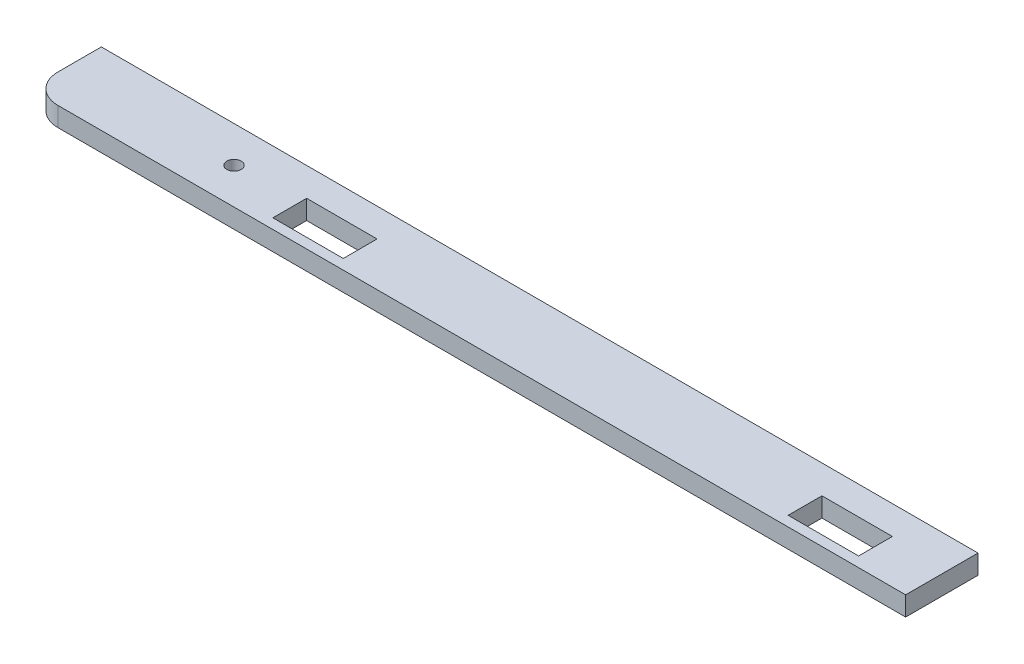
ISO-10303-21;
HEADER;
FILE_DESCRIPTION(('STEP AP214'),'2;1');
FILE_NAME('part.step','',(''),(''),'','','');
FILE_SCHEMA(('AUTOMOTIVE_DESIGN { 1 0 10303 214 1 1 1 1 }'));
ENDSEC;
DATA;
#1=APPLICATION_CONTEXT('core data for automotive mechanical design processes');
#2=APPLICATION_PROTOCOL_DEFINITION('international standard','automotive_design',2000,#1);
#3=PRODUCT_CONTEXT('',#1,'mechanical');
#4=PRODUCT('Part','Part','',(#3));
#5=PRODUCT_RELATED_PRODUCT_CATEGORY('part','',(#4));
#6=PRODUCT_DEFINITION_FORMATION('','',#4);
#7=PRODUCT_DEFINITION_CONTEXT('part definition',#1,'design');
#8=PRODUCT_DEFINITION('design','',#6,#7);
#9=PRODUCT_DEFINITION_SHAPE('','',#8);
#10=(LENGTH_UNIT() NAMED_UNIT(*) SI_UNIT(.MILLI.,.METRE.));
#11=(NAMED_UNIT(*) PLANE_ANGLE_UNIT() SI_UNIT($,.RADIAN.));
#12=(NAMED_UNIT(*) SI_UNIT($,.STERADIAN.) SOLID_ANGLE_UNIT());
#13=UNCERTAINTY_MEASURE_WITH_UNIT(LENGTH_MEASURE(1.E-05),#10,'distance_accuracy_value','');
#14=(GEOMETRIC_REPRESENTATION_CONTEXT(3) GLOBAL_UNCERTAINTY_ASSIGNED_CONTEXT((#13)) GLOBAL_UNIT_ASSIGNED_CONTEXT((#10,
#11,#12)) REPRESENTATION_CONTEXT('',''));
#15=CARTESIAN_POINT('',(0.,0.,0.));
#16=DIRECTION('',(0.,0.,1.));
#17=DIRECTION('',(1.,0.,0.));
#18=AXIS2_PLACEMENT_3D('',#15,#16,#17);
#19=CARTESIAN_POINT('',(-105.85,-1.,106.));
#20=DIRECTION('',(-1.,0.,0.));
#21=DIRECTION('',(0.,0.,1.));
#22=AXIS2_PLACEMENT_3D('',#19,#20,#21);
#23=PLANE('',#22);
#24=DIRECTION('',(0.,0.,1.));
#25=VECTOR('',#24,1.);
#26=CARTESIAN_POINT('',(-105.85,-1.,106.));
#27=LINE('',#26,#25);
#28=CARTESIAN_POINT('',(-105.85,-1.,106.));
#29=VERTEX_POINT('',#28);
#30=CARTESIAN_POINT('',(-105.85,-1.,115.));
#31=VERTEX_POINT('',#30);
#32=EDGE_CURVE('E180',#29,#31,#27,.T.);
#33=ORIENTED_EDGE('',*,*,#32,.T.);
#34=DIRECTION('',(0.,1.,0.));
#35=VECTOR('',#34,1.);
#36=CARTESIAN_POINT('',(-105.85,-1.,115.));
#37=LINE('',#36,#35);
#38=CARTESIAN_POINT('',(-105.85,3.,115.));
#39=VERTEX_POINT('',#38);
#40=EDGE_CURVE('E149',#31,#39,#37,.T.);
#41=ORIENTED_EDGE('',*,*,#40,.T.);
#42=DIRECTION('',(0.,0.,1.));
#43=VECTOR('',#42,1.);
#44=CARTESIAN_POINT('',(-105.85,3.,106.));
#45=LINE('',#44,#43);
#46=CARTESIAN_POINT('',(-105.85,3.,106.));
#47=VERTEX_POINT('',#46);
#48=EDGE_CURVE('E164',#47,#39,#45,.T.);
#49=ORIENTED_EDGE('',*,*,#48,.F.);
#50=DIRECTION('',(0.,1.,0.));
#51=VECTOR('',#50,1.);
#52=CARTESIAN_POINT('',(-105.85,-1.,106.));
#53=LINE('',#52,#51);
#54=EDGE_CURVE('E198',#29,#47,#53,.T.);
#55=ORIENTED_EDGE('',*,*,#54,.F.);
#56=EDGE_LOOP('',(#33,#41,#49,#55));
#57=FACE_BOUND('',#56,.T.);
#58=ADVANCED_FACE('F35',(#57),#23,.T.);
#59=CARTESIAN_POINT('',(75.85,-1.,106.));
#60=DIRECTION('',(0.,0.,-1.));
#61=DIRECTION('',(-1.,0.,0.));
#62=AXIS2_PLACEMENT_3D('',#59,#60,#61);
#63=PLANE('',#62);
#64=DIRECTION('',(-1.,0.,0.));
#65=VECTOR('',#64,1.);
#66=CARTESIAN_POINT('',(75.85,3.,106.));
#67=LINE('',#66,#65);
#68=CARTESIAN_POINT('',(75.85,3.,106.));
#69=VERTEX_POINT('',#68);
#70=EDGE_CURVE('E186',#69,#47,#67,.T.);
#71=ORIENTED_EDGE('',*,*,#70,.F.);
#72=DIRECTION('',(0.,1.,0.));
#73=VECTOR('',#72,1.);
#74=CARTESIAN_POINT('',(75.85,-1.,106.));
#75=LINE('',#74,#73);
#76=CARTESIAN_POINT('',(75.85,-1.,106.));
#77=VERTEX_POINT('',#76);
#78=EDGE_CURVE('E201',#77,#69,#75,.T.);
#79=ORIENTED_EDGE('',*,*,#78,.F.);
#80=DIRECTION('',(-1.,0.,0.));
#81=VECTOR('',#80,1.);
#82=CARTESIAN_POINT('',(75.85,-1.,106.));
#83=LINE('',#82,#81);
#84=EDGE_CURVE('E192',#77,#29,#83,.T.);
#85=ORIENTED_EDGE('',*,*,#84,.T.);
#86=ORIENTED_EDGE('',*,*,#54,.T.);
#87=EDGE_LOOP('',(#71,#79,#85,#86));
#88=FACE_BOUND('',#87,.T.);
#89=ADVANCED_FACE('F246',(#88),#63,.T.);
#90=CARTESIAN_POINT('',(75.85,-1.,121.));
#91=DIRECTION('',(1.,0.,0.));
#92=DIRECTION('',(0.,0.,-1.));
#93=AXIS2_PLACEMENT_3D('',#90,#91,#92);
#94=PLANE('',#93);
#95=DIRECTION('',(0.,0.,-1.));
#96=VECTOR('',#95,1.);
#97=CARTESIAN_POINT('',(75.85,3.,121.));
#98=LINE('',#97,#96);
#99=CARTESIAN_POINT('',(75.85,3.,121.));
#100=VERTEX_POINT('',#99);
#101=EDGE_CURVE('E189',#100,#69,#98,.T.);
#102=ORIENTED_EDGE('',*,*,#101,.F.);
#103=DIRECTION('',(0.,1.,0.));
#104=VECTOR('',#103,1.);
#105=CARTESIAN_POINT('',(75.85,-1.,121.));
#106=LINE('',#105,#104);
#107=CARTESIAN_POINT('',(75.85,-1.,121.));
#108=VERTEX_POINT('',#107);
#109=EDGE_CURVE('E204',#108,#100,#106,.T.);
#110=ORIENTED_EDGE('',*,*,#109,.F.);
#111=DIRECTION('',(0.,0.,-1.));
#112=VECTOR('',#111,1.);
#113=CARTESIAN_POINT('',(75.85,-1.,121.));
#114=LINE('',#113,#112);
#115=EDGE_CURVE('E200',#108,#77,#114,.T.);
#116=ORIENTED_EDGE('',*,*,#115,.T.);
#117=ORIENTED_EDGE('',*,*,#78,.T.);
#118=EDGE_LOOP('',(#102,#110,#116,#117));
#119=FACE_BOUND('',#118,.T.);
#120=ADVANCED_FACE('F242',(#119),#94,.T.);
#121=CARTESIAN_POINT('',(-105.85,-1.,121.));
#122=DIRECTION('',(0.,0.,1.));
#123=DIRECTION('',(1.,0.,0.));
#124=AXIS2_PLACEMENT_3D('',#121,#122,#123);
#125=PLANE('',#124);
#126=DIRECTION('',(1.,0.,0.));
#127=VECTOR('',#126,1.);
#128=CARTESIAN_POINT('',(-105.85,3.,121.));
#129=LINE('',#128,#127);
#130=CARTESIAN_POINT('',(-99.85,3.,121.));
#131=VERTEX_POINT('',#130);
#132=EDGE_CURVE('E187',#131,#100,#129,.T.);
#133=ORIENTED_EDGE('',*,*,#132,.F.);
#134=DIRECTION('',(0.,1.,0.));
#135=VECTOR('',#134,1.);
#136=CARTESIAN_POINT('',(-99.85,-1.,121.));
#137=LINE('',#136,#135);
#138=CARTESIAN_POINT('',(-99.85,-1.,121.));
#139=VERTEX_POINT('',#138);
#140=EDGE_CURVE('E43',#131,#139,#137,.F.);
#141=ORIENTED_EDGE('',*,*,#140,.T.);
#142=DIRECTION('',(1.,0.,0.));
#143=VECTOR('',#142,1.);
#144=CARTESIAN_POINT('',(-105.85,-1.,121.));
#145=LINE('',#144,#143);
#146=EDGE_CURVE('E203',#139,#108,#145,.T.);
#147=ORIENTED_EDGE('',*,*,#146,.T.);
#148=ORIENTED_EDGE('',*,*,#109,.T.);
#149=EDGE_LOOP('',(#133,#141,#147,#148));
#150=FACE_BOUND('',#149,.T.);
#151=ADVANCED_FACE('F253',(#150),#125,.T.);
#152=CARTESIAN_POINT('',(0.,-1.,0.));
#153=DIRECTION('',(0.,1.,0.));
#154=DIRECTION('',(0.,0.,1.));
#155=AXIS2_PLACEMENT_3D('',#152,#153,#154);
#156=PLANE('',#155);
#157=DIRECTION('',(1.,0.,0.));
#158=VECTOR('',#157,1.);
#159=CARTESIAN_POINT('',(-57.4,-1.,111.9));
#160=LINE('',#159,#158);
#161=CARTESIAN_POINT('',(-57.4,-1.,111.9));
#162=VERTEX_POINT('',#161);
#163=CARTESIAN_POINT('',(-42.7999999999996,-1.,111.9));
#164=VERTEX_POINT('',#163);
#165=EDGE_CURVE('E144',#162,#164,#160,.T.);
#166=ORIENTED_EDGE('',*,*,#165,.F.);
#167=DIRECTION('',(0.,0.,-1.));
#168=VECTOR('',#167,1.);
#169=CARTESIAN_POINT('',(-57.4,-1.,111.9));
#170=LINE('',#169,#168);
#171=CARTESIAN_POINT('',(-57.4,-1.,118.9));
#172=VERTEX_POINT('',#171);
#173=EDGE_CURVE('E127',#172,#162,#170,.T.);
#174=ORIENTED_EDGE('',*,*,#173,.F.);
#175=DIRECTION('',(-1.,0.,0.));
#176=VECTOR('',#175,1.);
#177=CARTESIAN_POINT('',(-57.4,-1.,118.9));
#178=LINE('',#177,#176);
#179=CARTESIAN_POINT('',(-42.7999999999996,-1.,118.9));
#180=VERTEX_POINT('',#179);
#181=EDGE_CURVE('E210',#180,#172,#178,.T.);
#182=ORIENTED_EDGE('',*,*,#181,.F.);
#183=DIRECTION('',(0.,0.,1.));
#184=VECTOR('',#183,1.);
#185=CARTESIAN_POINT('',(-42.7999999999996,-1.,111.9));
#186=LINE('',#185,#184);
#187=EDGE_CURVE('E154',#164,#180,#186,.T.);
#188=ORIENTED_EDGE('',*,*,#187,.F.);
#189=EDGE_LOOP('',(#166,#174,#182,#188));
#190=FACE_BOUND('',#189,.T.);
#191=DIRECTION('',(-1.,0.,0.));
#192=VECTOR('',#191,1.);
#193=CARTESIAN_POINT('',(49.3999999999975,-1.,111.899999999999));
#194=LINE('',#193,#192);
#195=CARTESIAN_POINT('',(63.9999999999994,-1.,111.899999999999));
#196=VERTEX_POINT('',#195);
#197=CARTESIAN_POINT('',(49.3999999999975,-1.,111.899999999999));
#198=VERTEX_POINT('',#197);
#199=EDGE_CURVE('E206',#196,#198,#194,.T.);
#200=ORIENTED_EDGE('',*,*,#199,.T.);
#201=DIRECTION('',(0.,0.,1.));
#202=VECTOR('',#201,1.);
#203=CARTESIAN_POINT('',(49.3999999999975,-1.,111.899999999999));
#204=LINE('',#203,#202);
#205=CARTESIAN_POINT('',(49.3999999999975,-1.,118.9));
#206=VERTEX_POINT('',#205);
#207=EDGE_CURVE('E402',#198,#206,#204,.T.);
#208=ORIENTED_EDGE('',*,*,#207,.T.);
#209=DIRECTION('',(1.,0.,0.));
#210=VECTOR('',#209,1.);
#211=CARTESIAN_POINT('',(49.3999999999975,-1.,118.9));
#212=LINE('',#211,#210);
#213=CARTESIAN_POINT('',(63.9999999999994,-1.,118.899999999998));
#214=VERTEX_POINT('',#213);
#215=EDGE_CURVE('E407',#206,#214,#212,.T.);
#216=ORIENTED_EDGE('',*,*,#215,.T.);
#217=DIRECTION('',(0.,0.,-1.));
#218=VECTOR('',#217,1.);
#219=CARTESIAN_POINT('',(63.9999999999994,-1.,111.899999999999));
#220=LINE('',#219,#218);
#221=EDGE_CURVE('E406',#214,#196,#220,.T.);
#222=ORIENTED_EDGE('',*,*,#221,.T.);
#223=EDGE_LOOP('',(#200,#208,#216,#222));
#224=FACE_BOUND('',#223,.T.);
#225=CARTESIAN_POINT('',(-70.85,-1.,113.5));
#226=DIRECTION('',(0.,1.,0.));
#227=DIRECTION('',(0.,0.,1.));
#228=AXIS2_PLACEMENT_3D('',#225,#226,#227);
#229=CIRCLE('',#228,1.5);
#230=CARTESIAN_POINT('',(-70.85,-1.,115.));
#231=VERTEX_POINT('',#230);
#232=EDGE_CURVE('E171',#231,#231,#229,.T.);
#233=ORIENTED_EDGE('',*,*,#232,.T.);
#234=EDGE_LOOP('',(#233));
#235=FACE_BOUND('',#234,.T.);
#236=ORIENTED_EDGE('',*,*,#146,.F.);
#237=CARTESIAN_POINT('',(-99.85,-1.,115.));
#238=DIRECTION('',(0.,1.,0.));
#239=DIRECTION('',(0.,0.,1.));
#240=AXIS2_PLACEMENT_3D('',#237,#238,#239);
#241=CIRCLE('',#240,6.);
#242=EDGE_CURVE('E11',#139,#31,#241,.F.);
#243=ORIENTED_EDGE('',*,*,#242,.T.);
#244=ORIENTED_EDGE('',*,*,#32,.F.);
#245=ORIENTED_EDGE('',*,*,#84,.F.);
#246=ORIENTED_EDGE('',*,*,#115,.F.);
#247=EDGE_LOOP('',(#236,#243,#244,#245,#246));
#248=FACE_BOUND('',#247,.T.);
#249=ADVANCED_FACE('F151',(#190,#224,#235,#248),#156,.F.);
#250=CARTESIAN_POINT('',(0.,3.,0.));
#251=DIRECTION('',(0.,1.,0.));
#252=DIRECTION('',(0.,0.,1.));
#253=AXIS2_PLACEMENT_3D('',#250,#251,#252);
#254=PLANE('',#253);
#255=DIRECTION('',(0.,0.,-1.));
#256=VECTOR('',#255,1.);
#257=CARTESIAN_POINT('',(-57.4,3.,111.9));
#258=LINE('',#257,#256);
#259=CARTESIAN_POINT('',(-57.4,3.,118.9));
#260=VERTEX_POINT('',#259);
#261=CARTESIAN_POINT('',(-57.4,3.,111.9));
#262=VERTEX_POINT('',#261);
#263=EDGE_CURVE('E169',#260,#262,#258,.T.);
#264=ORIENTED_EDGE('',*,*,#263,.T.);
#265=DIRECTION('',(1.,0.,0.));
#266=VECTOR('',#265,1.);
#267=CARTESIAN_POINT('',(-57.4,3.,111.9));
#268=LINE('',#267,#266);
#269=CARTESIAN_POINT('',(-42.7999999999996,3.,111.9));
#270=VERTEX_POINT('',#269);
#271=EDGE_CURVE('E147',#262,#270,#268,.T.);
#272=ORIENTED_EDGE('',*,*,#271,.T.);
#273=DIRECTION('',(0.,0.,1.));
#274=VECTOR('',#273,1.);
#275=CARTESIAN_POINT('',(-42.7999999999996,3.,111.9));
#276=LINE('',#275,#274);
#277=CARTESIAN_POINT('',(-42.7999999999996,3.,118.9));
#278=VERTEX_POINT('',#277);
#279=EDGE_CURVE('E165',#270,#278,#276,.T.);
#280=ORIENTED_EDGE('',*,*,#279,.T.);
#281=DIRECTION('',(-1.,0.,0.));
#282=VECTOR('',#281,1.);
#283=CARTESIAN_POINT('',(-57.4,3.,118.9));
#284=LINE('',#283,#282);
#285=EDGE_CURVE('E161',#278,#260,#284,.T.);
#286=ORIENTED_EDGE('',*,*,#285,.T.);
#287=EDGE_LOOP('',(#264,#272,#280,#286));
#288=FACE_BOUND('',#287,.T.);
#289=DIRECTION('',(0.,0.,1.));
#290=VECTOR('',#289,1.);
#291=CARTESIAN_POINT('',(49.3999999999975,3.,111.899999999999));
#292=LINE('',#291,#290);
#293=CARTESIAN_POINT('',(49.3999999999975,3.,111.899999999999));
#294=VERTEX_POINT('',#293);
#295=CARTESIAN_POINT('',(49.3999999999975,3.,118.9));
#296=VERTEX_POINT('',#295);
#297=EDGE_CURVE('E225',#294,#296,#292,.T.);
#298=ORIENTED_EDGE('',*,*,#297,.F.);
#299=DIRECTION('',(-1.,0.,0.));
#300=VECTOR('',#299,1.);
#301=CARTESIAN_POINT('',(49.3999999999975,3.,111.899999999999));
#302=LINE('',#301,#300);
#303=CARTESIAN_POINT('',(63.9999999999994,3.,111.899999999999));
#304=VERTEX_POINT('',#303);
#305=EDGE_CURVE('E393',#304,#294,#302,.T.);
#306=ORIENTED_EDGE('',*,*,#305,.F.);
#307=DIRECTION('',(0.,0.,-1.));
#308=VECTOR('',#307,1.);
#309=CARTESIAN_POINT('',(63.9999999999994,3.,111.899999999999));
#310=LINE('',#309,#308);
#311=CARTESIAN_POINT('',(63.9999999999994,3.,118.899999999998));
#312=VERTEX_POINT('',#311);
#313=EDGE_CURVE('E391',#312,#304,#310,.T.);
#314=ORIENTED_EDGE('',*,*,#313,.F.);
#315=DIRECTION('',(1.,0.,0.));
#316=VECTOR('',#315,1.);
#317=CARTESIAN_POINT('',(49.3999999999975,3.,118.9));
#318=LINE('',#317,#316);
#319=EDGE_CURVE('E384',#296,#312,#318,.T.);
#320=ORIENTED_EDGE('',*,*,#319,.F.);
#321=EDGE_LOOP('',(#298,#306,#314,#320));
#322=FACE_BOUND('',#321,.T.);
#323=CARTESIAN_POINT('',(-70.85,3.,113.5));
#324=DIRECTION('',(0.,1.,0.));
#325=DIRECTION('',(0.,0.,1.));
#326=AXIS2_PLACEMENT_3D('',#323,#324,#325);
#327=CIRCLE('',#326,1.5);
#328=CARTESIAN_POINT('',(-70.85,3.,115.));
#329=VERTEX_POINT('',#328);
#330=EDGE_CURVE('E197',#329,#329,#327,.T.);
#331=ORIENTED_EDGE('',*,*,#330,.F.);
#332=EDGE_LOOP('',(#331));
#333=FACE_BOUND('',#332,.T.);
#334=ORIENTED_EDGE('',*,*,#48,.T.);
#335=CARTESIAN_POINT('',(-99.85,3.,115.));
#336=DIRECTION('',(0.,1.,0.));
#337=DIRECTION('',(0.,0.,1.));
#338=AXIS2_PLACEMENT_3D('',#335,#336,#337);
#339=CIRCLE('',#338,6.);
#340=EDGE_CURVE('E57',#39,#131,#339,.T.);
#341=ORIENTED_EDGE('',*,*,#340,.T.);
#342=ORIENTED_EDGE('',*,*,#132,.T.);
#343=ORIENTED_EDGE('',*,*,#101,.T.);
#344=ORIENTED_EDGE('',*,*,#70,.T.);
#345=EDGE_LOOP('',(#334,#341,#342,#343,#344));
#346=FACE_BOUND('',#345,.T.);
#347=ADVANCED_FACE('F183',(#288,#322,#333,#346),#254,.T.);
#348=CARTESIAN_POINT('',(-70.85,-1.,113.5));
#349=DIRECTION('',(0.,1.,0.));
#350=DIRECTION('',(0.,0.,1.));
#351=AXIS2_PLACEMENT_3D('',#348,#349,#350);
#352=CYLINDRICAL_SURFACE('',#351,1.5);
#353=ORIENTED_EDGE('',*,*,#232,.F.);
#354=EDGE_LOOP('',(#353));
#355=FACE_BOUND('',#354,.T.);
#356=ORIENTED_EDGE('',*,*,#330,.T.);
#357=EDGE_LOOP('',(#356));
#358=FACE_BOUND('',#357,.T.);
#359=ADVANCED_FACE('F219',(#355,#358),#352,.F.);
#360=CARTESIAN_POINT('',(49.3999999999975,-1.,111.899999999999));
#361=DIRECTION('',(-1.,0.,0.));
#362=DIRECTION('',(0.,0.,1.));
#363=AXIS2_PLACEMENT_3D('',#360,#361,#362);
#364=PLANE('',#363);
#365=ORIENTED_EDGE('',*,*,#297,.T.);
#366=DIRECTION('',(0.,1.,0.));
#367=VECTOR('',#366,1.);
#368=CARTESIAN_POINT('',(49.3999999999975,-1.,118.9));
#369=LINE('',#368,#367);
#370=EDGE_CURVE('E138',#206,#296,#369,.T.);
#371=ORIENTED_EDGE('',*,*,#370,.F.);
#372=ORIENTED_EDGE('',*,*,#207,.F.);
#373=DIRECTION('',(0.,1.,0.));
#374=VECTOR('',#373,1.);
#375=CARTESIAN_POINT('',(49.3999999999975,-1.,111.899999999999));
#376=LINE('',#375,#374);
#377=EDGE_CURVE('E230',#198,#294,#376,.T.);
#378=ORIENTED_EDGE('',*,*,#377,.T.);
#379=EDGE_LOOP('',(#365,#371,#372,#378));
#380=FACE_BOUND('',#379,.T.);
#381=ADVANCED_FACE('F285',(#380),#364,.F.);
#382=CARTESIAN_POINT('',(49.3999999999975,-1.,111.899999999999));
#383=DIRECTION('',(0.,0.,-1.));
#384=DIRECTION('',(-1.,0.,0.));
#385=AXIS2_PLACEMENT_3D('',#382,#383,#384);
#386=PLANE('',#385);
#387=ORIENTED_EDGE('',*,*,#305,.T.);
#388=ORIENTED_EDGE('',*,*,#377,.F.);
#389=ORIENTED_EDGE('',*,*,#199,.F.);
#390=DIRECTION('',(0.,1.,0.));
#391=VECTOR('',#390,1.);
#392=CARTESIAN_POINT('',(63.9999999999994,-1.,111.899999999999));
#393=LINE('',#392,#391);
#394=EDGE_CURVE('E394',#196,#304,#393,.T.);
#395=ORIENTED_EDGE('',*,*,#394,.T.);
#396=EDGE_LOOP('',(#387,#388,#389,#395));
#397=FACE_BOUND('',#396,.T.);
#398=ADVANCED_FACE('F293',(#397),#386,.F.);
#399=CARTESIAN_POINT('',(63.9999999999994,-1.,111.899999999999));
#400=DIRECTION('',(1.,0.,0.));
#401=DIRECTION('',(0.,0.,-1.));
#402=AXIS2_PLACEMENT_3D('',#399,#400,#401);
#403=PLANE('',#402);
#404=ORIENTED_EDGE('',*,*,#313,.T.);
#405=ORIENTED_EDGE('',*,*,#394,.F.);
#406=ORIENTED_EDGE('',*,*,#221,.F.);
#407=DIRECTION('',(0.,1.,0.));
#408=VECTOR('',#407,1.);
#409=CARTESIAN_POINT('',(63.9999999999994,-1.,118.899999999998));
#410=LINE('',#409,#408);
#411=EDGE_CURVE('E387',#214,#312,#410,.T.);
#412=ORIENTED_EDGE('',*,*,#411,.T.);
#413=EDGE_LOOP('',(#404,#405,#406,#412));
#414=FACE_BOUND('',#413,.T.);
#415=ADVANCED_FACE('F300',(#414),#403,.F.);
#416=CARTESIAN_POINT('',(49.3999999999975,-1.,118.9));
#417=DIRECTION('',(0.,0.,1.));
#418=DIRECTION('',(1.,0.,0.));
#419=AXIS2_PLACEMENT_3D('',#416,#417,#418);
#420=PLANE('',#419);
#421=ORIENTED_EDGE('',*,*,#319,.T.);
#422=ORIENTED_EDGE('',*,*,#411,.F.);
#423=ORIENTED_EDGE('',*,*,#215,.F.);
#424=ORIENTED_EDGE('',*,*,#370,.T.);
#425=EDGE_LOOP('',(#421,#422,#423,#424));
#426=FACE_BOUND('',#425,.T.);
#427=ADVANCED_FACE('F263',(#426),#420,.F.);
#428=CARTESIAN_POINT('',(-57.4,3.,111.9));
#429=DIRECTION('',(-1.,0.,0.));
#430=DIRECTION('',(0.,0.,1.));
#431=AXIS2_PLACEMENT_3D('',#428,#429,#430);
#432=PLANE('',#431);
#433=ORIENTED_EDGE('',*,*,#173,.T.);
#434=DIRECTION('',(0.,-1.,0.));
#435=VECTOR('',#434,1.);
#436=CARTESIAN_POINT('',(-57.4,3.,111.9));
#437=LINE('',#436,#435);
#438=EDGE_CURVE('E131',#262,#162,#437,.T.);
#439=ORIENTED_EDGE('',*,*,#438,.F.);
#440=ORIENTED_EDGE('',*,*,#263,.F.);
#441=DIRECTION('',(0.,-1.,0.));
#442=VECTOR('',#441,1.);
#443=CARTESIAN_POINT('',(-57.4,3.,118.9));
#444=LINE('',#443,#442);
#445=EDGE_CURVE('E133',#260,#172,#444,.T.);
#446=ORIENTED_EDGE('',*,*,#445,.T.);
#447=EDGE_LOOP('',(#433,#439,#440,#446));
#448=FACE_BOUND('',#447,.T.);
#449=ADVANCED_FACE('F129',(#448),#432,.F.);
#450=CARTESIAN_POINT('',(-57.4,3.,118.9));
#451=DIRECTION('',(0.,0.,1.));
#452=DIRECTION('',(1.,0.,0.));
#453=AXIS2_PLACEMENT_3D('',#450,#451,#452);
#454=PLANE('',#453);
#455=ORIENTED_EDGE('',*,*,#181,.T.);
#456=ORIENTED_EDGE('',*,*,#445,.F.);
#457=ORIENTED_EDGE('',*,*,#285,.F.);
#458=DIRECTION('',(0.,-1.,0.));
#459=VECTOR('',#458,1.);
#460=CARTESIAN_POINT('',(-42.7999999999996,3.,118.9));
#461=LINE('',#460,#459);
#462=EDGE_CURVE('E208',#278,#180,#461,.T.);
#463=ORIENTED_EDGE('',*,*,#462,.T.);
#464=EDGE_LOOP('',(#455,#456,#457,#463));
#465=FACE_BOUND('',#464,.T.);
#466=ADVANCED_FACE('F212',(#465),#454,.F.);
#467=CARTESIAN_POINT('',(-42.7999999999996,3.,111.9));
#468=DIRECTION('',(1.,0.,0.));
#469=DIRECTION('',(0.,0.,-1.));
#470=AXIS2_PLACEMENT_3D('',#467,#468,#469);
#471=PLANE('',#470);
#472=ORIENTED_EDGE('',*,*,#187,.T.);
#473=ORIENTED_EDGE('',*,*,#462,.F.);
#474=ORIENTED_EDGE('',*,*,#279,.F.);
#475=DIRECTION('',(0.,-1.,0.));
#476=VECTOR('',#475,1.);
#477=CARTESIAN_POINT('',(-42.7999999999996,3.,111.9));
#478=LINE('',#477,#476);
#479=EDGE_CURVE('E155',#270,#164,#478,.T.);
#480=ORIENTED_EDGE('',*,*,#479,.T.);
#481=EDGE_LOOP('',(#472,#473,#474,#480));
#482=FACE_BOUND('',#481,.T.);
#483=ADVANCED_FACE('F215',(#482),#471,.F.);
#484=CARTESIAN_POINT('',(-57.4,3.,111.9));
#485=DIRECTION('',(0.,0.,-1.));
#486=DIRECTION('',(-1.,0.,0.));
#487=AXIS2_PLACEMENT_3D('',#484,#485,#486);
#488=PLANE('',#487);
#489=ORIENTED_EDGE('',*,*,#165,.T.);
#490=ORIENTED_EDGE('',*,*,#479,.F.);
#491=ORIENTED_EDGE('',*,*,#271,.F.);
#492=ORIENTED_EDGE('',*,*,#438,.T.);
#493=EDGE_LOOP('',(#489,#490,#491,#492));
#494=FACE_BOUND('',#493,.T.);
#495=ADVANCED_FACE('F142',(#494),#488,.F.);
#496=CARTESIAN_POINT('',(-99.85,-1.,115.));
#497=DIRECTION('',(0.,1.,0.));
#498=DIRECTION('',(0.,0.,1.));
#499=AXIS2_PLACEMENT_3D('',#496,#497,#498);
#500=CYLINDRICAL_SURFACE('',#499,6.);
#501=ORIENTED_EDGE('',*,*,#242,.F.);
#502=ORIENTED_EDGE('',*,*,#140,.F.);
#503=ORIENTED_EDGE('',*,*,#340,.F.);
#504=ORIENTED_EDGE('',*,*,#40,.F.);
#505=EDGE_LOOP('',(#501,#502,#503,#504));
#506=FACE_BOUND('',#505,.T.);
#507=ADVANCED_FACE('F37',(#506),#500,.T.);
#508=CLOSED_SHELL('',(#58,#89,#120,#151,#249,#347,#359,#381,#398,#415,#427,#449,#466,#483,#495,#507));
#509=MANIFOLD_SOLID_BREP('B2',#508);
#510=ADVANCED_BREP_SHAPE_REPRESENTATION('',(#18,#509),#14);
#511=SHAPE_DEFINITION_REPRESENTATION(#9,#510);
ENDSEC;
END-ISO-10303-21;
